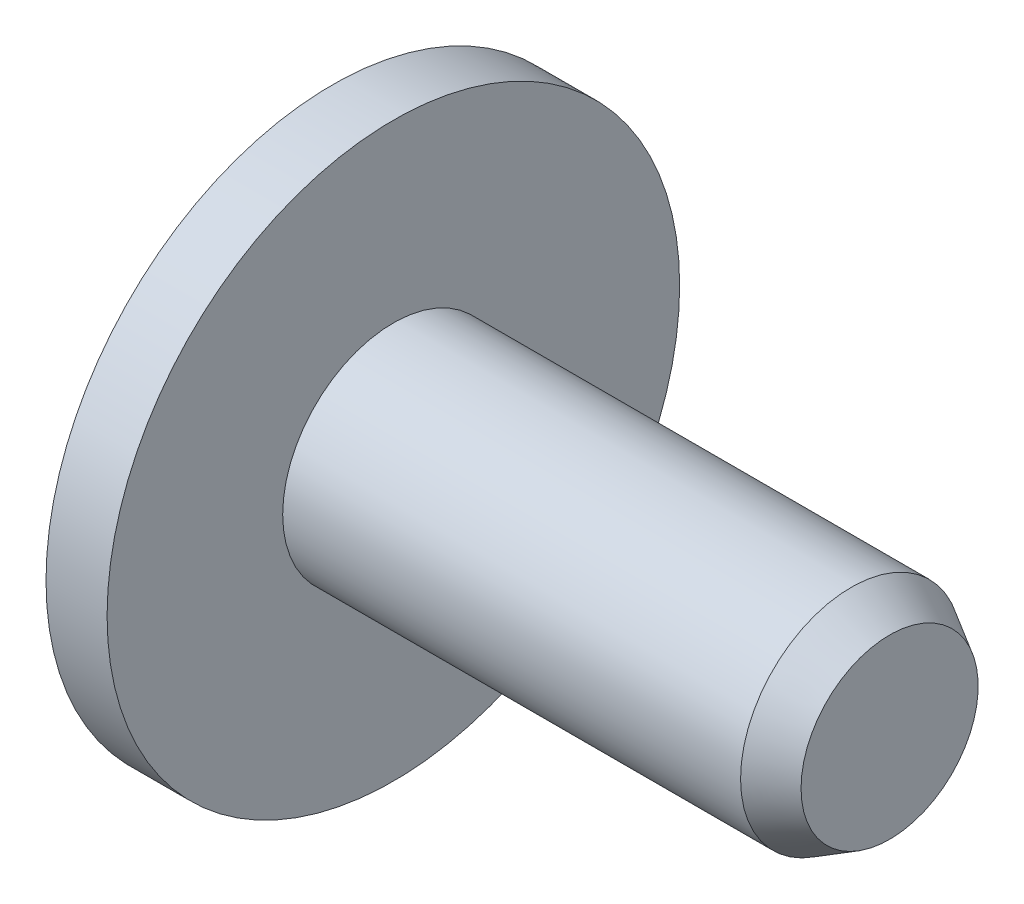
from build123d import *

# Parameters (mm, degrees)
CHAMFER1_SIZE      = 0.29
CHAMFER1_SIZE2     = 0.502294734
CUT_EXTRUDE1_DEPTH = 1.58
DRAFT1_ANGLE       = -35
DRAFT2_ANGLE       = -8
FILLET1_R          = 0.25


with BuildPart() as part:
    # Sketch1 → Revolve1 (revolve)
    with BuildSketch(Plane.XY, mode=Mode.PRIVATE) as revolve1_sk:
        with BuildLine():
            Line((0, 3.75), (0, 1.45))
            Line((0, 1.45), (6.5, 1.45))
            Line((6.5, 1.45), (6.5, 0))
            Line((6.5, 0), (-2.35, 0))
            ThreePointArc((-2.35, 0), (-1.940427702, 1.71610023), (-0.8, 3.0622704))
            Line((-0.8, 3.0622704), (-0.8, 3.75))
            Line((-0.8, 3.75), (0, 3.75))
        make_face()
    revolve(revolve1_sk.sketch.rotate(Axis((-6.478309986, 0, 0), (1, 0, 0)), 90), axis=Axis((-6.478309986, 0, 0), (1, 0, 0)))

    # Chamfer1
    chamfer1_edges = [part.edges().sort_by_distance(p)[0] for p in [
        (6.5, 0, -1.45),
    ]]
    chamfer1_side = [part.faces().sort_by_distance(p)[0] for p in [
        (6.5, 0, 0),
    ]]
    chamfer(chamfer1_edges, length=CHAMFER1_SIZE, length2=CHAMFER1_SIZE2, reference=chamfer1_side[0])

    # Sketch4 → Cut-Extrude1 (cut)
    with BuildSketch(Plane(origin=(-2.35, 0, 0), x_dir=(0, 0, -1), z_dir=(1, 0, 0))):
        Polygon((0.3, 1.5), (-0.3, 1.5), (-0.3, 0.3), (-1.5, 0.3), (-1.5, -0.3), (-0.3, -0.3), (-0.3, -1.5), (0.3, -1.5), (0.3, -0.3), (1.5, -0.3), (1.5, 0.3), (0.3, 0.3), align=None)
    extrude(amount=CUT_EXTRUDE1_DEPTH, mode=Mode.SUBTRACT)

    # Draft1
    draft1_faces = [part.faces().sort_by_distance(p)[0] for p in [
        (-1.403564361, 0, -1.5),
        (-1.403564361, -1.5, 0),
        (-1.403564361, 0, 1.5),
        (-1.403564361, 1.5, 0),
    ]]
    draft(draft1_faces, Plane.YZ.offset(-2.35), DRAFT1_ANGLE)

    # Draft2
    draft2_faces = [part.faces().sort_by_distance(p)[0] for p in [
        (-1.709589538, 0.648659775, -0.3),
        (-1.709589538, 0.3, -0.648659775),
        (-1.709589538, -0.3, -0.648659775),
        (-1.709589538, -0.648659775, -0.3),
        (-1.709589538, -0.648659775, 0.3),
        (-1.709589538, -0.3, 0.648659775),
        (-1.709589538, 0.3, 0.648659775),
        (-1.709589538, 0.648659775, 0.3),
    ]]
    draft(draft2_faces, Plane.YZ.offset(-2.35), DRAFT2_ANGLE)

    # Fillet1
    fillet1_edges = [part.edges().sort_by_distance(p)[0] for p in [
        (-1.548378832, 0.187339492, -0.187339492),
        (-1.548378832, 0.187339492, 0.187339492),
        (-1.548378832, -0.187339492, 0.187339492),
        (-1.548378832, -0.187339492, -0.187339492),
    ]]
    fillet(fillet1_edges, radius=FILLET1_R)


solid = part.part
